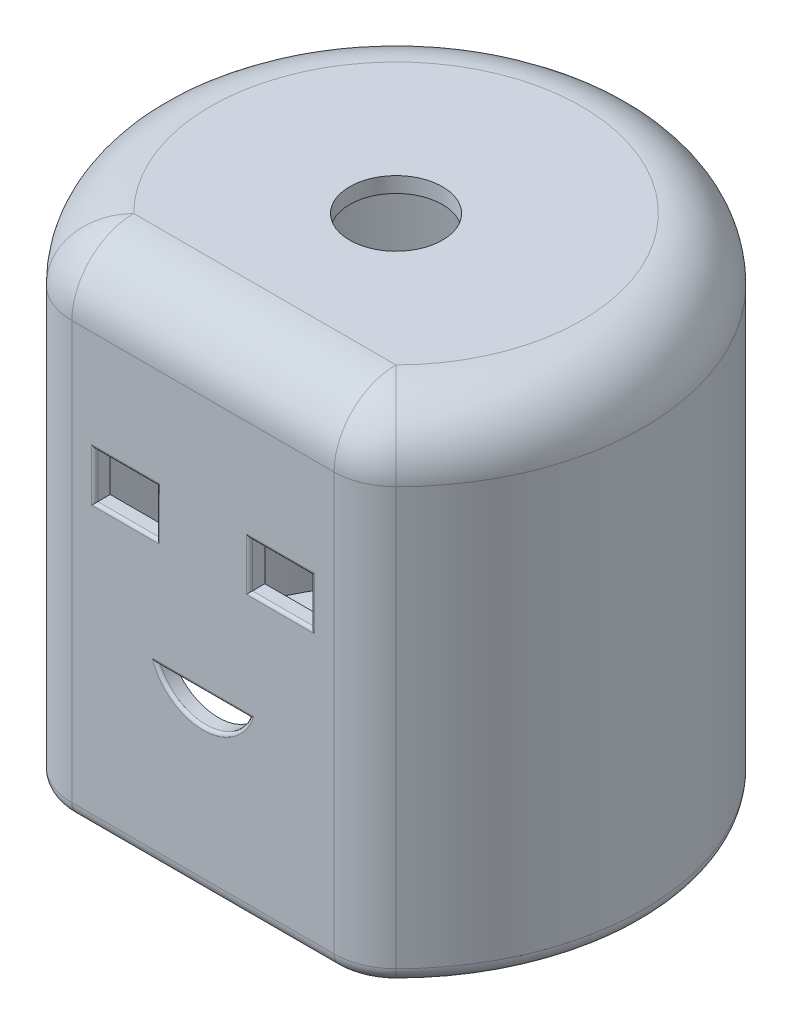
ISO-10303-21;
HEADER;
FILE_DESCRIPTION(('STEP AP214'),'2;1');
FILE_NAME('part.step','',(''),(''),'','','');
FILE_SCHEMA(('AUTOMOTIVE_DESIGN { 1 0 10303 214 1 1 1 1 }'));
ENDSEC;
DATA;
#1=APPLICATION_CONTEXT('core data for automotive mechanical design processes');
#2=APPLICATION_PROTOCOL_DEFINITION('international standard','automotive_design',2000,#1);
#3=PRODUCT_CONTEXT('',#1,'mechanical');
#4=PRODUCT('Part','Part','',(#3));
#5=PRODUCT_RELATED_PRODUCT_CATEGORY('part','',(#4));
#6=PRODUCT_DEFINITION_FORMATION('','',#4);
#7=PRODUCT_DEFINITION_CONTEXT('part definition',#1,'design');
#8=PRODUCT_DEFINITION('design','',#6,#7);
#9=PRODUCT_DEFINITION_SHAPE('','',#8);
#10=(LENGTH_UNIT() NAMED_UNIT(*) SI_UNIT(.MILLI.,.METRE.));
#11=(NAMED_UNIT(*) PLANE_ANGLE_UNIT() SI_UNIT($,.RADIAN.));
#12=(NAMED_UNIT(*) SI_UNIT($,.STERADIAN.) SOLID_ANGLE_UNIT());
#13=UNCERTAINTY_MEASURE_WITH_UNIT(LENGTH_MEASURE(1.E-05),#10,'distance_accuracy_value','');
#14=(GEOMETRIC_REPRESENTATION_CONTEXT(3) GLOBAL_UNCERTAINTY_ASSIGNED_CONTEXT((#13)) GLOBAL_UNIT_ASSIGNED_CONTEXT((#10,
#11,#12)) REPRESENTATION_CONTEXT('',''));
#15=CARTESIAN_POINT('',(0.,0.,0.));
#16=DIRECTION('',(0.,0.,1.));
#17=DIRECTION('',(1.,0.,0.));
#18=AXIS2_PLACEMENT_3D('',#15,#16,#17);
#19=CARTESIAN_POINT('',(0.,203.2,0.));
#20=DIRECTION('',(0.,-1.,0.));
#21=DIRECTION('',(0.,0.,-1.));
#22=AXIS2_PLACEMENT_3D('',#19,#20,#21);
#23=CYLINDRICAL_SURFACE('',#22,101.6);
#24=DIRECTION('',(0.,-1.,0.));
#25=VECTOR('',#24,1.);
#26=CARTESIAN_POINT('',(71.8021096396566,203.2,71.8819661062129));
#27=LINE('',#26,#25);
#28=CARTESIAN_POINT('',(71.8021096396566,177.8,71.8819661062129));
#29=VERTEX_POINT('',#28);
#30=CARTESIAN_POINT('',(71.8021096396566,6.34999999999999,71.8819661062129));
#31=VERTEX_POINT('',#30);
#32=EDGE_CURVE('E446',#29,#31,#27,.T.);
#33=ORIENTED_EDGE('',*,*,#32,.T.);
#34=CARTESIAN_POINT('',(0.,6.34999999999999,0.));
#35=DIRECTION('',(0.,-1.,0.));
#36=DIRECTION('',(0.,0.,-1.));
#37=AXIS2_PLACEMENT_3D('',#34,#35,#36);
#38=CIRCLE('',#37,101.6);
#39=CARTESIAN_POINT('',(-71.8021096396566,6.34999999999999,71.8819661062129));
#40=VERTEX_POINT('',#39);
#41=EDGE_CURVE('E498',#31,#40,#38,.F.);
#42=ORIENTED_EDGE('',*,*,#41,.T.);
#43=DIRECTION('',(0.,-1.,0.));
#44=VECTOR('',#43,1.);
#45=CARTESIAN_POINT('',(-71.8021096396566,203.2,71.8819661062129));
#46=LINE('',#45,#44);
#47=CARTESIAN_POINT('',(-71.8021096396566,177.8,71.8819661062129));
#48=VERTEX_POINT('',#47);
#49=EDGE_CURVE('E440',#40,#48,#46,.F.);
#50=ORIENTED_EDGE('',*,*,#49,.T.);
#51=CARTESIAN_POINT('',(0.,177.8,0.));
#52=DIRECTION('',(0.,-1.,0.));
#53=DIRECTION('',(0.,0.,-1.));
#54=AXIS2_PLACEMENT_3D('',#51,#52,#53);
#55=CIRCLE('',#54,101.6);
#56=EDGE_CURVE('E443',#48,#29,#55,.T.);
#57=ORIENTED_EDGE('',*,*,#56,.T.);
#58=EDGE_LOOP('',(#33,#42,#50,#57));
#59=FACE_BOUND('',#58,.T.);
#60=ADVANCED_FACE('F47',(#59),#23,.T.);
#61=CARTESIAN_POINT('',(-63.5,203.2,79.3114745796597));
#62=DIRECTION('',(0.,0.,-1.));
#63=DIRECTION('',(-1.,0.,0.));
#64=AXIS2_PLACEMENT_3D('',#61,#62,#63);
#65=PLANE('',#64);
#66=DIRECTION('',(1.,0.,0.));
#67=VECTOR('',#66,1.);
#68=CARTESIAN_POINT('',(-63.5,116.205,79.3114745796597));
#69=LINE('',#68,#67);
#70=CARTESIAN_POINT('',(45.72,116.205,79.3114745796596));
#71=VERTEX_POINT('',#70);
#72=CARTESIAN_POINT('',(17.78,116.205,79.3114745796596));
#73=VERTEX_POINT('',#72);
#74=EDGE_CURVE('E579',#71,#73,#69,.F.);
#75=ORIENTED_EDGE('',*,*,#74,.T.);
#76=DIRECTION('',(0.,-1.,0.));
#77=VECTOR('',#76,1.);
#78=CARTESIAN_POINT('',(17.78,203.2,79.3114745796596));
#79=LINE('',#78,#77);
#80=CARTESIAN_POINT('',(17.78,137.795,79.3114745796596));
#81=VERTEX_POINT('',#80);
#82=EDGE_CURVE('E582',#73,#81,#79,.F.);
#83=ORIENTED_EDGE('',*,*,#82,.T.);
#84=DIRECTION('',(-1.,0.,0.));
#85=VECTOR('',#84,1.);
#86=CARTESIAN_POINT('',(-63.5,137.795,79.3114745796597));
#87=LINE('',#86,#85);
#88=CARTESIAN_POINT('',(45.72,137.795,79.3114745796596));
#89=VERTEX_POINT('',#88);
#90=EDGE_CURVE('E573',#81,#89,#87,.F.);
#91=ORIENTED_EDGE('',*,*,#90,.T.);
#92=DIRECTION('',(0.,1.,0.));
#93=VECTOR('',#92,1.);
#94=CARTESIAN_POINT('',(45.72,203.2,79.3114745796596));
#95=LINE('',#94,#93);
#96=EDGE_CURVE('E576',#89,#71,#95,.F.);
#97=ORIENTED_EDGE('',*,*,#96,.T.);
#98=EDGE_LOOP('',(#75,#83,#91,#97));
#99=FACE_BOUND('',#98,.T.);
#100=DIRECTION('',(1.,0.,0.));
#101=VECTOR('',#100,1.);
#102=CARTESIAN_POINT('',(-63.5,116.205,79.3114745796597));
#103=LINE('',#102,#101);
#104=CARTESIAN_POINT('',(-17.78,116.205,79.3114745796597));
#105=VERTEX_POINT('',#104);
#106=CARTESIAN_POINT('',(-45.72,116.205,79.3114745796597));
#107=VERTEX_POINT('',#106);
#108=EDGE_CURVE('E566',#105,#107,#103,.F.);
#109=ORIENTED_EDGE('',*,*,#108,.T.);
#110=DIRECTION('',(0.,-1.,0.));
#111=VECTOR('',#110,1.);
#112=CARTESIAN_POINT('',(-45.72,203.2,79.3114745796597));
#113=LINE('',#112,#111);
#114=CARTESIAN_POINT('',(-45.72,137.795,79.3114745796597));
#115=VERTEX_POINT('',#114);
#116=EDGE_CURVE('E569',#107,#115,#113,.F.);
#117=ORIENTED_EDGE('',*,*,#116,.T.);
#118=DIRECTION('',(-1.,0.,0.));
#119=VECTOR('',#118,1.);
#120=CARTESIAN_POINT('',(-63.5,137.795,79.3114745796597));
#121=LINE('',#120,#119);
#122=CARTESIAN_POINT('',(-17.78,137.795,79.3114745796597));
#123=VERTEX_POINT('',#122);
#124=EDGE_CURVE('E560',#115,#123,#121,.F.);
#125=ORIENTED_EDGE('',*,*,#124,.T.);
#126=DIRECTION('',(0.,1.,0.));
#127=VECTOR('',#126,1.);
#128=CARTESIAN_POINT('',(-17.78,203.2,79.3114745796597));
#129=LINE('',#128,#127);
#130=EDGE_CURVE('E563',#123,#105,#129,.F.);
#131=ORIENTED_EDGE('',*,*,#130,.T.);
#132=EDGE_LOOP('',(#109,#117,#125,#131));
#133=FACE_BOUND('',#132,.T.);
#134=DIRECTION('',(-1.,0.,0.));
#135=VECTOR('',#134,1.);
#136=CARTESIAN_POINT('',(-63.5,74.295,79.3114745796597));
#137=LINE('',#136,#135);
#138=CARTESIAN_POINT('',(-20.8682294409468,74.295,79.3114745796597));
#139=VERTEX_POINT('',#138);
#140=CARTESIAN_POINT('',(20.8682294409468,74.295,79.3114745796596));
#141=VERTEX_POINT('',#140);
#142=EDGE_CURVE('E553',#139,#141,#137,.F.);
#143=ORIENTED_EDGE('',*,*,#142,.T.);
#144=CARTESIAN_POINT('',(0.,80.9625,79.3114745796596));
#145=DIRECTION('',(0.,0.,-1.));
#146=DIRECTION('',(-1.,0.,0.));
#147=AXIS2_PLACEMENT_3D('',#144,#145,#146);
#148=CIRCLE('',#147,21.9075);
#149=EDGE_CURVE('E556',#141,#139,#148,.T.);
#150=ORIENTED_EDGE('',*,*,#149,.T.);
#151=EDGE_LOOP('',(#143,#150));
#152=FACE_BOUND('',#151,.T.);
#153=DIRECTION('',(0.,-1.,0.));
#154=VECTOR('',#153,1.);
#155=CARTESIAN_POINT('',(-53.8515822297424,203.2,79.3114745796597));
#156=LINE('',#155,#154);
#157=CARTESIAN_POINT('',(-53.8515822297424,177.8,79.3114745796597));
#158=VERTEX_POINT('',#157);
#159=CARTESIAN_POINT('',(-53.8515822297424,6.34999999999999,79.3114745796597));
#160=VERTEX_POINT('',#159);
#161=EDGE_CURVE('E429',#158,#160,#156,.T.);
#162=ORIENTED_EDGE('',*,*,#161,.T.);
#163=DIRECTION('',(1.,0.,0.));
#164=VECTOR('',#163,1.);
#165=CARTESIAN_POINT('',(53.8515822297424,6.34999999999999,79.3114745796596));
#166=LINE('',#165,#164);
#167=CARTESIAN_POINT('',(53.8515822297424,6.34999999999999,79.3114745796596));
#168=VERTEX_POINT('',#167);
#169=EDGE_CURVE('E492',#160,#168,#166,.T.);
#170=ORIENTED_EDGE('',*,*,#169,.T.);
#171=DIRECTION('',(0.,-1.,0.));
#172=VECTOR('',#171,1.);
#173=CARTESIAN_POINT('',(53.8515822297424,203.2,79.3114745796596));
#174=LINE('',#173,#172);
#175=CARTESIAN_POINT('',(53.8515822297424,177.8,79.3114745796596));
#176=VERTEX_POINT('',#175);
#177=EDGE_CURVE('E437',#168,#176,#174,.F.);
#178=ORIENTED_EDGE('',*,*,#177,.T.);
#179=DIRECTION('',(1.,0.,0.));
#180=VECTOR('',#179,1.);
#181=CARTESIAN_POINT('',(-63.5,177.8,79.3114745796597));
#182=LINE('',#181,#180);
#183=EDGE_CURVE('E433',#176,#158,#182,.F.);
#184=ORIENTED_EDGE('',*,*,#183,.T.);
#185=EDGE_LOOP('',(#162,#170,#178,#184));
#186=FACE_BOUND('',#185,.T.);
#187=ADVANCED_FACE('F724',(#99,#133,#152,#186),#65,.F.);
#188=CARTESIAN_POINT('',(0.,203.2,0.));
#189=DIRECTION('',(0.,-1.,0.));
#190=DIRECTION('',(0.,0.,-1.));
#191=AXIS2_PLACEMENT_3D('',#188,#189,#190);
#192=PLANE('',#191);
#193=CARTESIAN_POINT('',(0.,203.2,0.));
#194=DIRECTION('',(0.,1.,0.));
#195=DIRECTION('',(0.,0.,1.));
#196=AXIS2_PLACEMENT_3D('',#193,#194,#195);
#197=CIRCLE('',#196,19.05);
#198=CARTESIAN_POINT('',(0.,203.2,19.05));
#199=VERTEX_POINT('',#198);
#200=EDGE_CURVE('E324',#199,#199,#197,.T.);
#201=ORIENTED_EDGE('',*,*,#200,.F.);
#202=EDGE_LOOP('',(#201));
#203=FACE_BOUND('',#202,.T.);
#204=CARTESIAN_POINT('',(0.,203.2,0.));
#205=DIRECTION('',(0.,-1.,0.));
#206=DIRECTION('',(0.,0.,-1.));
#207=AXIS2_PLACEMENT_3D('',#204,#205,#206);
#208=CIRCLE('',#207,76.2);
#209=CARTESIAN_POINT('',(53.8515822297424,203.2,53.9114745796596));
#210=VERTEX_POINT('',#209);
#211=CARTESIAN_POINT('',(-53.8515822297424,203.2,53.9114745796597));
#212=VERTEX_POINT('',#211);
#213=EDGE_CURVE('E421',#210,#212,#208,.F.);
#214=ORIENTED_EDGE('',*,*,#213,.T.);
#215=DIRECTION('',(1.,0.,0.));
#216=VECTOR('',#215,1.);
#217=CARTESIAN_POINT('',(0.,203.2,53.9114745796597));
#218=LINE('',#217,#216);
#219=EDGE_CURVE('E424',#212,#210,#218,.T.);
#220=ORIENTED_EDGE('',*,*,#219,.T.);
#221=EDGE_LOOP('',(#214,#220));
#222=FACE_BOUND('',#221,.T.);
#223=ADVANCED_FACE('F702',(#203,#222),#192,.F.);
#224=CARTESIAN_POINT('',(-53.8515822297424,203.2,53.9114745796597));
#225=DIRECTION('',(0.,-1.,0.));
#226=DIRECTION('',(0.,0.,-1.));
#227=AXIS2_PLACEMENT_3D('',#224,#225,#226);
#228=CYLINDRICAL_SURFACE('',#227,25.4);
#229=ORIENTED_EDGE('',*,*,#49,.F.);
#230=CARTESIAN_POINT('',(-53.8515822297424,6.34999999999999,53.9114745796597));
#231=DIRECTION('',(0.,-1.,0.));
#232=DIRECTION('',(0.,0.,-1.));
#233=AXIS2_PLACEMENT_3D('',#230,#231,#232);
#234=CIRCLE('',#233,25.4);
#235=EDGE_CURVE('E488',#40,#160,#234,.F.);
#236=ORIENTED_EDGE('',*,*,#235,.T.);
#237=ORIENTED_EDGE('',*,*,#161,.F.);
#238=CARTESIAN_POINT('',(-53.8515822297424,177.8,53.9114745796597));
#239=DIRECTION('',(0.,1.,0.));
#240=DIRECTION('',(0.,0.,1.));
#241=AXIS2_PLACEMENT_3D('',#238,#239,#240);
#242=CIRCLE('',#241,25.4);
#243=EDGE_CURVE('E425',#48,#158,#242,.T.);
#244=ORIENTED_EDGE('',*,*,#243,.F.);
#245=EDGE_LOOP('',(#229,#236,#237,#244));
#246=FACE_BOUND('',#245,.T.);
#247=ADVANCED_FACE('F698',(#246),#228,.T.);
#248=CARTESIAN_POINT('',(0.,177.8,0.));
#249=DIRECTION('',(0.,-1.,0.));
#250=DIRECTION('',(0.,0.,-1.));
#251=AXIS2_PLACEMENT_3D('',#248,#249,#250);
#252=TOROIDAL_SURFACE('',#251,76.2,25.4);
#253=CARTESIAN_POINT('',(53.8515822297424,177.8,53.9114745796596));
#254=DIRECTION('',(-0.707499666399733,0.,0.706713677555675));
#255=DIRECTION('',(0.706713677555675,0.,0.707499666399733));
#256=AXIS2_PLACEMENT_3D('',#253,#254,#255);
#257=CIRCLE('',#256,25.4);
#258=EDGE_CURVE('E462',#29,#210,#257,.T.);
#259=ORIENTED_EDGE('',*,*,#258,.F.);
#260=ORIENTED_EDGE('',*,*,#56,.F.);
#261=CARTESIAN_POINT('',(-53.8515822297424,177.8,53.9114745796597));
#262=DIRECTION('',(0.707499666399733,0.,0.706713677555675));
#263=DIRECTION('',(0.706713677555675,0.,-0.707499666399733));
#264=AXIS2_PLACEMENT_3D('',#261,#262,#263);
#265=CIRCLE('',#264,25.4);
#266=EDGE_CURVE('E466',#212,#48,#265,.T.);
#267=ORIENTED_EDGE('',*,*,#266,.F.);
#268=ORIENTED_EDGE('',*,*,#213,.F.);
#269=EDGE_LOOP('',(#259,#260,#267,#268));
#270=FACE_BOUND('',#269,.T.);
#271=ADVANCED_FACE('F701',(#270),#252,.T.);
#272=CARTESIAN_POINT('',(53.8515822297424,203.2,53.9114745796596));
#273=DIRECTION('',(0.,-1.,0.));
#274=DIRECTION('',(0.,0.,-1.));
#275=AXIS2_PLACEMENT_3D('',#272,#273,#274);
#276=CYLINDRICAL_SURFACE('',#275,25.4);
#277=ORIENTED_EDGE('',*,*,#177,.F.);
#278=CARTESIAN_POINT('',(53.8515822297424,6.34999999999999,53.9114745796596));
#279=DIRECTION('',(0.,-1.,0.));
#280=DIRECTION('',(0.,0.,-1.));
#281=AXIS2_PLACEMENT_3D('',#278,#279,#280);
#282=CIRCLE('',#281,25.4);
#283=EDGE_CURVE('E495',#168,#31,#282,.F.);
#284=ORIENTED_EDGE('',*,*,#283,.T.);
#285=ORIENTED_EDGE('',*,*,#32,.F.);
#286=CARTESIAN_POINT('',(53.8515822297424,177.8,53.9114745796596));
#287=DIRECTION('',(0.,1.,0.));
#288=DIRECTION('',(0.,0.,1.));
#289=AXIS2_PLACEMENT_3D('',#286,#287,#288);
#290=CIRCLE('',#289,25.4);
#291=EDGE_CURVE('E458',#176,#29,#290,.T.);
#292=ORIENTED_EDGE('',*,*,#291,.F.);
#293=EDGE_LOOP('',(#277,#284,#285,#292));
#294=FACE_BOUND('',#293,.T.);
#295=ADVANCED_FACE('F706',(#294),#276,.T.);
#296=CARTESIAN_POINT('',(-53.8515822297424,177.8,53.9114745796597));
#297=DIRECTION('',(0.,1.,0.));
#298=DIRECTION('',(0.,0.,1.));
#299=AXIS2_PLACEMENT_3D('',#296,#297,#298);
#300=SPHERICAL_SURFACE('',#299,25.4);
#301=ORIENTED_EDGE('',*,*,#266,.T.);
#302=ORIENTED_EDGE('',*,*,#243,.T.);
#303=CARTESIAN_POINT('',(-53.8515822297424,177.8,53.9114745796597));
#304=DIRECTION('',(-1.,0.,0.));
#305=DIRECTION('',(0.,-1.,0.));
#306=AXIS2_PLACEMENT_3D('',#303,#304,#305);
#307=CIRCLE('',#306,25.4);
#308=EDGE_CURVE('E454',#212,#158,#307,.F.);
#309=ORIENTED_EDGE('',*,*,#308,.F.);
#310=EDGE_LOOP('',(#301,#302,#309));
#311=FACE_BOUND('',#310,.T.);
#312=ADVANCED_FACE('F710',(#311),#300,.T.);
#313=CARTESIAN_POINT('',(53.8515822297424,177.8,53.9114745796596));
#314=DIRECTION('',(0.,1.,0.));
#315=DIRECTION('',(-1.,0.,0.));
#316=AXIS2_PLACEMENT_3D('',#313,#314,#315);
#317=SPHERICAL_SURFACE('',#316,25.4);
#318=ORIENTED_EDGE('',*,*,#291,.T.);
#319=ORIENTED_EDGE('',*,*,#258,.T.);
#320=CARTESIAN_POINT('',(53.8515822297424,177.8,53.9114745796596));
#321=DIRECTION('',(1.,0.,0.));
#322=DIRECTION('',(0.,0.,-1.));
#323=AXIS2_PLACEMENT_3D('',#320,#321,#322);
#324=CIRCLE('',#323,25.4);
#325=EDGE_CURVE('E451',#176,#210,#324,.F.);
#326=ORIENTED_EDGE('',*,*,#325,.F.);
#327=EDGE_LOOP('',(#318,#319,#326));
#328=FACE_BOUND('',#327,.T.);
#329=ADVANCED_FACE('F714',(#328),#317,.T.);
#330=CARTESIAN_POINT('',(0.,177.8,53.9114745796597));
#331=DIRECTION('',(1.,0.,0.));
#332=DIRECTION('',(0.,0.,-1.));
#333=AXIS2_PLACEMENT_3D('',#330,#331,#332);
#334=CYLINDRICAL_SURFACE('',#333,25.4);
#335=ORIENTED_EDGE('',*,*,#308,.T.);
#336=ORIENTED_EDGE('',*,*,#183,.F.);
#337=ORIENTED_EDGE('',*,*,#325,.T.);
#338=ORIENTED_EDGE('',*,*,#219,.F.);
#339=EDGE_LOOP('',(#335,#336,#337,#338));
#340=FACE_BOUND('',#339,.T.);
#341=ADVANCED_FACE('F684',(#340),#334,.T.);
#342=CARTESIAN_POINT('',(53.8515822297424,6.34999999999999,53.9114745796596));
#343=DIRECTION('',(0.,-1.,0.));
#344=DIRECTION('',(0.,0.,-1.));
#345=AXIS2_PLACEMENT_3D('',#342,#343,#344);
#346=TOROIDAL_SURFACE('',#345,19.05,6.35);
#347=CARTESIAN_POINT('',(67.3144777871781,6.34999999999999,67.3893432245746));
#348=DIRECTION('',(0.707499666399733,0.,-0.706713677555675));
#349=DIRECTION('',(-0.706713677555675,0.,-0.707499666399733));
#350=AXIS2_PLACEMENT_3D('',#347,#348,#349);
#351=CIRCLE('',#350,6.35);
#352=CARTESIAN_POINT('',(67.3144777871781,0.,67.3893432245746));
#353=VERTEX_POINT('',#352);
#354=EDGE_CURVE('E507',#31,#353,#351,.T.);
#355=ORIENTED_EDGE('',*,*,#354,.F.);
#356=ORIENTED_EDGE('',*,*,#283,.F.);
#357=CARTESIAN_POINT('',(53.8515822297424,6.35,72.9614745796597));
#358=DIRECTION('',(-1.,0.,0.));
#359=DIRECTION('',(0.,0.,1.));
#360=AXIS2_PLACEMENT_3D('',#357,#358,#359);
#361=CIRCLE('',#360,6.35);
#362=CARTESIAN_POINT('',(53.8515822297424,0.,72.9614745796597));
#363=VERTEX_POINT('',#362);
#364=EDGE_CURVE('E455',#363,#168,#361,.T.);
#365=ORIENTED_EDGE('',*,*,#364,.F.);
#366=CARTESIAN_POINT('',(53.8515822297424,0.,53.9114745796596));
#367=DIRECTION('',(0.,-1.,0.));
#368=DIRECTION('',(0.,0.,-1.));
#369=AXIS2_PLACEMENT_3D('',#366,#367,#368);
#370=CIRCLE('',#369,19.05);
#371=EDGE_CURVE('E476',#353,#363,#370,.T.);
#372=ORIENTED_EDGE('',*,*,#371,.F.);
#373=EDGE_LOOP('',(#355,#356,#365,#372));
#374=FACE_BOUND('',#373,.T.);
#375=ADVANCED_FACE('F680',(#374),#346,.T.);
#376=CARTESIAN_POINT('',(-63.5,6.34999999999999,72.9614745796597));
#377=DIRECTION('',(-1.,0.,0.));
#378=DIRECTION('',(0.,0.,1.));
#379=AXIS2_PLACEMENT_3D('',#376,#377,#378);
#380=CYLINDRICAL_SURFACE('',#379,6.35);
#381=ORIENTED_EDGE('',*,*,#364,.T.);
#382=ORIENTED_EDGE('',*,*,#169,.F.);
#383=CARTESIAN_POINT('',(-53.8515822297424,6.35,72.9614745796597));
#384=DIRECTION('',(-1.,0.,0.));
#385=DIRECTION('',(0.,0.,1.));
#386=AXIS2_PLACEMENT_3D('',#383,#384,#385);
#387=CIRCLE('',#386,6.35);
#388=CARTESIAN_POINT('',(-53.8515822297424,0.,72.9614745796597));
#389=VERTEX_POINT('',#388);
#390=EDGE_CURVE('E504',#389,#160,#387,.T.);
#391=ORIENTED_EDGE('',*,*,#390,.F.);
#392=DIRECTION('',(1.,0.,0.));
#393=VECTOR('',#392,1.);
#394=CARTESIAN_POINT('',(-53.8515822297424,0.,72.9614745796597));
#395=LINE('',#394,#393);
#396=EDGE_CURVE('E480',#363,#389,#395,.F.);
#397=ORIENTED_EDGE('',*,*,#396,.F.);
#398=EDGE_LOOP('',(#381,#382,#391,#397));
#399=FACE_BOUND('',#398,.T.);
#400=ADVANCED_FACE('F683',(#399),#380,.T.);
#401=CARTESIAN_POINT('',(0.,6.34999999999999,0.));
#402=DIRECTION('',(0.,-1.,0.));
#403=DIRECTION('',(0.,0.,-1.));
#404=AXIS2_PLACEMENT_3D('',#401,#402,#403);
#405=TOROIDAL_SURFACE('',#404,95.25,6.35);
#406=ORIENTED_EDGE('',*,*,#354,.T.);
#407=CARTESIAN_POINT('',(0.,0.,0.));
#408=DIRECTION('',(0.,-1.,0.));
#409=DIRECTION('',(0.,0.,-1.));
#410=AXIS2_PLACEMENT_3D('',#407,#408,#409);
#411=CIRCLE('',#410,95.25);
#412=CARTESIAN_POINT('',(-67.314477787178,0.,67.3893432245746));
#413=VERTEX_POINT('',#412);
#414=EDGE_CURVE('E450',#413,#353,#411,.T.);
#415=ORIENTED_EDGE('',*,*,#414,.F.);
#416=CARTESIAN_POINT('',(-67.314477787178,6.34999999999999,67.3893432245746));
#417=DIRECTION('',(0.707499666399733,0.,0.706713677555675));
#418=DIRECTION('',(0.706713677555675,0.,-0.707499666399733));
#419=AXIS2_PLACEMENT_3D('',#416,#417,#418);
#420=CIRCLE('',#419,6.35);
#421=EDGE_CURVE('E375',#40,#413,#420,.T.);
#422=ORIENTED_EDGE('',*,*,#421,.F.);
#423=ORIENTED_EDGE('',*,*,#41,.F.);
#424=EDGE_LOOP('',(#406,#415,#422,#423));
#425=FACE_BOUND('',#424,.T.);
#426=ADVANCED_FACE('F688',(#425),#405,.T.);
#427=CARTESIAN_POINT('',(-53.8515822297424,6.34999999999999,53.9114745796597));
#428=DIRECTION('',(0.,-1.,0.));
#429=DIRECTION('',(0.,0.,-1.));
#430=AXIS2_PLACEMENT_3D('',#427,#428,#429);
#431=TOROIDAL_SURFACE('',#430,19.05,6.35);
#432=ORIENTED_EDGE('',*,*,#390,.T.);
#433=ORIENTED_EDGE('',*,*,#235,.F.);
#434=ORIENTED_EDGE('',*,*,#421,.T.);
#435=CARTESIAN_POINT('',(-53.8515822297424,0.,53.9114745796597));
#436=DIRECTION('',(0.,-1.,0.));
#437=DIRECTION('',(0.,0.,-1.));
#438=AXIS2_PLACEMENT_3D('',#435,#436,#437);
#439=CIRCLE('',#438,19.05);
#440=EDGE_CURVE('E484',#389,#413,#439,.T.);
#441=ORIENTED_EDGE('',*,*,#440,.F.);
#442=EDGE_LOOP('',(#432,#433,#434,#441));
#443=FACE_BOUND('',#442,.T.);
#444=ADVANCED_FACE('F692',(#443),#431,.T.);
#445=CARTESIAN_POINT('',(0.,203.2,0.));
#446=DIRECTION('',(0.,-1.,0.));
#447=DIRECTION('',(0.,0.,-1.));
#448=AXIS2_PLACEMENT_3D('',#445,#446,#447);
#449=CYLINDRICAL_SURFACE('',#448,95.25);
#450=CARTESIAN_POINT('',(0.,3.81,0.));
#451=DIRECTION('',(0.,1.,0.));
#452=DIRECTION('',(0.,0.,1.));
#453=AXIS2_PLACEMENT_3D('',#450,#451,#452);
#454=CIRCLE('',#453,95.25);
#455=CARTESIAN_POINT('',(67.3144777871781,3.81,67.3893432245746));
#456=VERTEX_POINT('',#455);
#457=CARTESIAN_POINT('',(-67.314477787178,3.81,67.3893432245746));
#458=VERTEX_POINT('',#457);
#459=EDGE_CURVE('E316',#456,#458,#454,.T.);
#460=ORIENTED_EDGE('',*,*,#459,.F.);
#461=DIRECTION('',(0.,-1.,0.));
#462=VECTOR('',#461,1.);
#463=CARTESIAN_POINT('',(67.3144777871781,203.2,67.3893432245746));
#464=LINE('',#463,#462);
#465=CARTESIAN_POINT('',(67.3144777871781,177.8,67.3893432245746));
#466=VERTEX_POINT('',#465);
#467=EDGE_CURVE('E371',#466,#456,#464,.T.);
#468=ORIENTED_EDGE('',*,*,#467,.F.);
#469=CARTESIAN_POINT('',(0.,177.8,0.));
#470=DIRECTION('',(0.,-1.,0.));
#471=DIRECTION('',(0.,0.,-1.));
#472=AXIS2_PLACEMENT_3D('',#469,#470,#471);
#473=CIRCLE('',#472,95.25);
#474=CARTESIAN_POINT('',(-67.314477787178,177.8,67.3893432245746));
#475=VERTEX_POINT('',#474);
#476=EDGE_CURVE('E376',#475,#466,#473,.T.);
#477=ORIENTED_EDGE('',*,*,#476,.F.);
#478=DIRECTION('',(0.,-1.,0.));
#479=VECTOR('',#478,1.);
#480=CARTESIAN_POINT('',(-67.314477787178,203.2,67.3893432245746));
#481=LINE('',#480,#479);
#482=EDGE_CURVE('E377',#458,#475,#481,.F.);
#483=ORIENTED_EDGE('',*,*,#482,.F.);
#484=EDGE_LOOP('',(#460,#468,#477,#483));
#485=FACE_BOUND('',#484,.T.);
#486=ADVANCED_FACE('F696',(#485),#449,.F.);
#487=CARTESIAN_POINT('',(-63.5,203.2,72.9614745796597));
#488=DIRECTION('',(0.,0.,-1.));
#489=DIRECTION('',(-1.,0.,0.));
#490=AXIS2_PLACEMENT_3D('',#487,#488,#489);
#491=PLANE('',#490);
#492=DIRECTION('',(1.,0.,0.));
#493=VECTOR('',#492,1.);
#494=CARTESIAN_POINT('',(53.8515822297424,3.81,72.9614745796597));
#495=LINE('',#494,#493);
#496=CARTESIAN_POINT('',(-53.8515822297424,3.81,72.9614745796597));
#497=VERTEX_POINT('',#496);
#498=CARTESIAN_POINT('',(53.8515822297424,3.81000000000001,72.9614745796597));
#499=VERTEX_POINT('',#498);
#500=EDGE_CURVE('E70',#497,#499,#495,.T.);
#501=ORIENTED_EDGE('',*,*,#500,.F.);
#502=DIRECTION('',(0.,1.,0.));
#503=VECTOR('',#502,1.);
#504=CARTESIAN_POINT('',(-53.8515822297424,203.2,72.9614745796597));
#505=LINE('',#504,#503);
#506=CARTESIAN_POINT('',(-53.8515822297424,177.8,72.9614745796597));
#507=VERTEX_POINT('',#506);
#508=EDGE_CURVE('E383',#507,#497,#505,.F.);
#509=ORIENTED_EDGE('',*,*,#508,.F.);
#510=DIRECTION('',(-1.,0.,0.));
#511=VECTOR('',#510,1.);
#512=CARTESIAN_POINT('',(-63.5,177.8,72.9614745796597));
#513=LINE('',#512,#511);
#514=CARTESIAN_POINT('',(53.8515822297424,177.8,72.9614745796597));
#515=VERTEX_POINT('',#514);
#516=EDGE_CURVE('E387',#515,#507,#513,.T.);
#517=ORIENTED_EDGE('',*,*,#516,.F.);
#518=DIRECTION('',(0.,1.,0.));
#519=VECTOR('',#518,1.);
#520=CARTESIAN_POINT('',(53.8515822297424,203.2,72.9614745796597));
#521=LINE('',#520,#519);
#522=EDGE_CURVE('E380',#499,#515,#521,.T.);
#523=ORIENTED_EDGE('',*,*,#522,.F.);
#524=EDGE_LOOP('',(#501,#509,#517,#523));
#525=FACE_BOUND('',#524,.T.);
#526=CARTESIAN_POINT('',(0.,80.9625,72.9614745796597));
#527=DIRECTION('',(0.,0.,-1.));
#528=DIRECTION('',(-1.,0.,0.));
#529=AXIS2_PLACEMENT_3D('',#526,#527,#528);
#530=CIRCLE('',#529,20.6375);
#531=CARTESIAN_POINT('',(19.05,73.025,72.9614745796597));
#532=VERTEX_POINT('',#531);
#533=CARTESIAN_POINT('',(-19.05,73.025,72.9614745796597));
#534=VERTEX_POINT('',#533);
#535=EDGE_CURVE('E542',#532,#534,#530,.T.);
#536=ORIENTED_EDGE('',*,*,#535,.F.);
#537=DIRECTION('',(1.,0.,0.));
#538=VECTOR('',#537,1.);
#539=CARTESIAN_POINT('',(-63.5,73.025,72.9614745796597));
#540=LINE('',#539,#538);
#541=EDGE_CURVE('E539',#534,#532,#540,.T.);
#542=ORIENTED_EDGE('',*,*,#541,.F.);
#543=EDGE_LOOP('',(#536,#542));
#544=FACE_BOUND('',#543,.T.);
#545=DIRECTION('',(0.,-1.,0.));
#546=VECTOR('',#545,1.);
#547=CARTESIAN_POINT('',(-19.05,203.2,72.9614745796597));
#548=LINE('',#547,#546);
#549=CARTESIAN_POINT('',(-19.05,136.525,72.9614745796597));
#550=VERTEX_POINT('',#549);
#551=CARTESIAN_POINT('',(-19.05,117.475,72.9614745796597));
#552=VERTEX_POINT('',#551);
#553=EDGE_CURVE('E536',#550,#552,#548,.T.);
#554=ORIENTED_EDGE('',*,*,#553,.F.);
#555=DIRECTION('',(1.,0.,0.));
#556=VECTOR('',#555,1.);
#557=CARTESIAN_POINT('',(-63.5,136.525,72.9614745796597));
#558=LINE('',#557,#556);
#559=CARTESIAN_POINT('',(-44.45,136.525,72.9614745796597));
#560=VERTEX_POINT('',#559);
#561=EDGE_CURVE('E526',#560,#550,#558,.T.);
#562=ORIENTED_EDGE('',*,*,#561,.F.);
#563=DIRECTION('',(0.,1.,0.));
#564=VECTOR('',#563,1.);
#565=CARTESIAN_POINT('',(-44.45,203.2,72.9614745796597));
#566=LINE('',#565,#564);
#567=CARTESIAN_POINT('',(-44.45,117.475,72.9614745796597));
#568=VERTEX_POINT('',#567);
#569=EDGE_CURVE('E529',#568,#560,#566,.T.);
#570=ORIENTED_EDGE('',*,*,#569,.F.);
#571=DIRECTION('',(-1.,0.,0.));
#572=VECTOR('',#571,1.);
#573=CARTESIAN_POINT('',(-63.5,117.475,72.9614745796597));
#574=LINE('',#573,#572);
#575=EDGE_CURVE('E533',#552,#568,#574,.T.);
#576=ORIENTED_EDGE('',*,*,#575,.F.);
#577=EDGE_LOOP('',(#554,#562,#570,#576));
#578=FACE_BOUND('',#577,.T.);
#579=DIRECTION('',(0.,-1.,0.));
#580=VECTOR('',#579,1.);
#581=CARTESIAN_POINT('',(44.45,203.2,72.9614745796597));
#582=LINE('',#581,#580);
#583=CARTESIAN_POINT('',(44.45,136.525,72.9614745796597));
#584=VERTEX_POINT('',#583);
#585=CARTESIAN_POINT('',(44.45,117.475,72.9614745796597));
#586=VERTEX_POINT('',#585);
#587=EDGE_CURVE('E523',#584,#586,#582,.T.);
#588=ORIENTED_EDGE('',*,*,#587,.F.);
#589=DIRECTION('',(1.,0.,0.));
#590=VECTOR('',#589,1.);
#591=CARTESIAN_POINT('',(-63.5,136.525,72.9614745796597));
#592=LINE('',#591,#590);
#593=CARTESIAN_POINT('',(19.05,136.525,72.9614745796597));
#594=VERTEX_POINT('',#593);
#595=EDGE_CURVE('E501',#594,#584,#592,.T.);
#596=ORIENTED_EDGE('',*,*,#595,.F.);
#597=DIRECTION('',(0.,1.,0.));
#598=VECTOR('',#597,1.);
#599=CARTESIAN_POINT('',(19.05,203.2,72.9614745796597));
#600=LINE('',#599,#598);
#601=CARTESIAN_POINT('',(19.05,117.475,72.9614745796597));
#602=VERTEX_POINT('',#601);
#603=EDGE_CURVE('E516',#602,#594,#600,.T.);
#604=ORIENTED_EDGE('',*,*,#603,.F.);
#605=DIRECTION('',(-1.,0.,0.));
#606=VECTOR('',#605,1.);
#607=CARTESIAN_POINT('',(-63.5,117.475,72.9614745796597));
#608=LINE('',#607,#606);
#609=EDGE_CURVE('E520',#586,#602,#608,.T.);
#610=ORIENTED_EDGE('',*,*,#609,.F.);
#611=EDGE_LOOP('',(#588,#596,#604,#610));
#612=FACE_BOUND('',#611,.T.);
#613=ADVANCED_FACE('F760',(#525,#544,#578,#612),#491,.T.);
#614=CARTESIAN_POINT('',(0.,196.85,0.));
#615=DIRECTION('',(0.,-1.,0.));
#616=DIRECTION('',(0.,0.,-1.));
#617=AXIS2_PLACEMENT_3D('',#614,#615,#616);
#618=PLANE('',#617);
#619=CARTESIAN_POINT('',(0.,196.85,0.));
#620=DIRECTION('',(0.,-1.,0.));
#621=DIRECTION('',(0.,0.,-1.));
#622=AXIS2_PLACEMENT_3D('',#619,#620,#621);
#623=CIRCLE('',#622,19.05);
#624=CARTESIAN_POINT('',(0.,196.85,-19.05));
#625=VERTEX_POINT('',#624);
#626=EDGE_CURVE('E328',#625,#625,#623,.T.);
#627=ORIENTED_EDGE('',*,*,#626,.F.);
#628=EDGE_LOOP('',(#627));
#629=FACE_BOUND('',#628,.T.);
#630=CARTESIAN_POINT('',(0.,196.85,0.));
#631=DIRECTION('',(0.,-1.,0.));
#632=DIRECTION('',(0.,0.,-1.));
#633=AXIS2_PLACEMENT_3D('',#630,#631,#632);
#634=CIRCLE('',#633,76.2);
#635=CARTESIAN_POINT('',(53.8515822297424,196.85,53.9114745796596));
#636=VERTEX_POINT('',#635);
#637=CARTESIAN_POINT('',(-53.8515822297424,196.85,53.9114745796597));
#638=VERTEX_POINT('',#637);
#639=EDGE_CURVE('E393',#636,#638,#634,.F.);
#640=ORIENTED_EDGE('',*,*,#639,.F.);
#641=DIRECTION('',(1.,0.,0.));
#642=VECTOR('',#641,1.);
#643=CARTESIAN_POINT('',(0.,196.85,53.9114745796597));
#644=LINE('',#643,#642);
#645=EDGE_CURVE('E388',#638,#636,#644,.T.);
#646=ORIENTED_EDGE('',*,*,#645,.F.);
#647=EDGE_LOOP('',(#640,#646));
#648=FACE_BOUND('',#647,.T.);
#649=ADVANCED_FACE('F756',(#629,#648),#618,.T.);
#650=CARTESIAN_POINT('',(-53.8515822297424,203.2,53.9114745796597));
#651=DIRECTION('',(0.,-1.,0.));
#652=DIRECTION('',(0.,0.,-1.));
#653=AXIS2_PLACEMENT_3D('',#650,#651,#652);
#654=CYLINDRICAL_SURFACE('',#653,19.05);
#655=ORIENTED_EDGE('',*,*,#508,.T.);
#656=CARTESIAN_POINT('',(-53.8515822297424,3.81,53.9114745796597));
#657=DIRECTION('',(0.,1.,0.));
#658=DIRECTION('',(0.,0.,1.));
#659=AXIS2_PLACEMENT_3D('',#656,#657,#658);
#660=CIRCLE('',#659,19.05);
#661=EDGE_CURVE('E319',#458,#497,#660,.T.);
#662=ORIENTED_EDGE('',*,*,#661,.F.);
#663=ORIENTED_EDGE('',*,*,#482,.T.);
#664=CARTESIAN_POINT('',(-53.8515822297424,177.8,53.9114745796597));
#665=DIRECTION('',(0.,1.,0.));
#666=DIRECTION('',(0.,0.,1.));
#667=AXIS2_PLACEMENT_3D('',#664,#665,#666);
#668=CIRCLE('',#667,19.05);
#669=EDGE_CURVE('E389',#475,#507,#668,.T.);
#670=ORIENTED_EDGE('',*,*,#669,.T.);
#671=EDGE_LOOP('',(#655,#662,#663,#670));
#672=FACE_BOUND('',#671,.T.);
#673=ADVANCED_FACE('F752',(#672),#654,.F.);
#674=CARTESIAN_POINT('',(0.,177.8,0.));
#675=DIRECTION('',(0.,-1.,0.));
#676=DIRECTION('',(0.,0.,-1.));
#677=AXIS2_PLACEMENT_3D('',#674,#675,#676);
#678=TOROIDAL_SURFACE('',#677,76.2,19.05);
#679=CARTESIAN_POINT('',(53.8515822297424,177.8,53.9114745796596));
#680=DIRECTION('',(-0.707499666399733,0.,0.706713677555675));
#681=DIRECTION('',(0.706713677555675,0.,0.707499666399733));
#682=AXIS2_PLACEMENT_3D('',#679,#680,#681);
#683=CIRCLE('',#682,19.05);
#684=EDGE_CURVE('E404',#466,#636,#683,.T.);
#685=ORIENTED_EDGE('',*,*,#684,.T.);
#686=ORIENTED_EDGE('',*,*,#639,.T.);
#687=CARTESIAN_POINT('',(-53.8515822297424,177.8,53.9114745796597));
#688=DIRECTION('',(-0.707499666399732,0.,-0.706713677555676));
#689=DIRECTION('',(-0.706713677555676,0.,0.707499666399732));
#690=AXIS2_PLACEMENT_3D('',#687,#688,#689);
#691=CIRCLE('',#690,19.05);
#692=EDGE_CURVE('E394',#638,#475,#691,.F.);
#693=ORIENTED_EDGE('',*,*,#692,.T.);
#694=ORIENTED_EDGE('',*,*,#476,.T.);
#695=EDGE_LOOP('',(#685,#686,#693,#694));
#696=FACE_BOUND('',#695,.T.);
#697=ADVANCED_FACE('F748',(#696),#678,.F.);
#698=CARTESIAN_POINT('',(53.8515822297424,203.2,53.9114745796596));
#699=DIRECTION('',(0.,-1.,0.));
#700=DIRECTION('',(0.,0.,-1.));
#701=AXIS2_PLACEMENT_3D('',#698,#699,#700);
#702=CYLINDRICAL_SURFACE('',#701,19.05);
#703=ORIENTED_EDGE('',*,*,#467,.T.);
#704=CARTESIAN_POINT('',(53.8515822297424,3.81,53.9114745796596));
#705=DIRECTION('',(0.,1.,0.));
#706=DIRECTION('',(0.,0.,1.));
#707=AXIS2_PLACEMENT_3D('',#704,#705,#706);
#708=CIRCLE('',#707,19.05);
#709=EDGE_CURVE('E280',#499,#456,#708,.T.);
#710=ORIENTED_EDGE('',*,*,#709,.F.);
#711=ORIENTED_EDGE('',*,*,#522,.T.);
#712=CARTESIAN_POINT('',(53.8515822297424,177.8,53.9114745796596));
#713=DIRECTION('',(0.,1.,0.));
#714=DIRECTION('',(-1.,0.,0.));
#715=AXIS2_PLACEMENT_3D('',#712,#713,#714);
#716=CIRCLE('',#715,19.05);
#717=EDGE_CURVE('E400',#515,#466,#716,.T.);
#718=ORIENTED_EDGE('',*,*,#717,.T.);
#719=EDGE_LOOP('',(#703,#710,#711,#718));
#720=FACE_BOUND('',#719,.T.);
#721=ADVANCED_FACE('F744',(#720),#702,.F.);
#722=CARTESIAN_POINT('',(-53.8515822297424,177.8,53.9114745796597));
#723=DIRECTION('',(0.,1.,0.));
#724=DIRECTION('',(0.,0.,1.));
#725=AXIS2_PLACEMENT_3D('',#722,#723,#724);
#726=SPHERICAL_SURFACE('',#725,19.05);
#727=ORIENTED_EDGE('',*,*,#692,.F.);
#728=CARTESIAN_POINT('',(-53.8515822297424,177.8,53.9114745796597));
#729=DIRECTION('',(1.,0.,0.));
#730=DIRECTION('',(0.,0.,-1.));
#731=AXIS2_PLACEMENT_3D('',#728,#729,#730);
#732=CIRCLE('',#731,19.05);
#733=EDGE_CURVE('E405',#638,#507,#732,.T.);
#734=ORIENTED_EDGE('',*,*,#733,.T.);
#735=ORIENTED_EDGE('',*,*,#669,.F.);
#736=EDGE_LOOP('',(#727,#734,#735));
#737=FACE_BOUND('',#736,.T.);
#738=ADVANCED_FACE('F740',(#737),#726,.F.);
#739=CARTESIAN_POINT('',(53.8515822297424,177.8,53.9114745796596));
#740=DIRECTION('',(0.,1.,0.));
#741=DIRECTION('',(-1.,0.,0.));
#742=AXIS2_PLACEMENT_3D('',#739,#740,#741);
#743=SPHERICAL_SURFACE('',#742,19.05);
#744=ORIENTED_EDGE('',*,*,#717,.F.);
#745=CARTESIAN_POINT('',(53.8515822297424,177.8,53.9114745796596));
#746=DIRECTION('',(1.,0.,0.));
#747=DIRECTION('',(0.,0.,-1.));
#748=AXIS2_PLACEMENT_3D('',#745,#746,#747);
#749=CIRCLE('',#748,19.05);
#750=EDGE_CURVE('E359',#515,#636,#749,.F.);
#751=ORIENTED_EDGE('',*,*,#750,.T.);
#752=ORIENTED_EDGE('',*,*,#684,.F.);
#753=EDGE_LOOP('',(#744,#751,#752));
#754=FACE_BOUND('',#753,.T.);
#755=ADVANCED_FACE('F736',(#754),#743,.F.);
#756=CARTESIAN_POINT('',(0.,177.8,53.9114745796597));
#757=DIRECTION('',(1.,0.,0.));
#758=DIRECTION('',(0.,0.,-1.));
#759=AXIS2_PLACEMENT_3D('',#756,#757,#758);
#760=CYLINDRICAL_SURFACE('',#759,19.05);
#761=ORIENTED_EDGE('',*,*,#733,.F.);
#762=ORIENTED_EDGE('',*,*,#645,.T.);
#763=ORIENTED_EDGE('',*,*,#750,.F.);
#764=ORIENTED_EDGE('',*,*,#516,.T.);
#765=EDGE_LOOP('',(#761,#762,#763,#764));
#766=FACE_BOUND('',#765,.T.);
#767=ADVANCED_FACE('F732',(#766),#760,.F.);
#768=CARTESIAN_POINT('',(44.45,136.525,66.6114745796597));
#769=DIRECTION('',(1.,0.,0.));
#770=DIRECTION('',(0.,1.,0.));
#771=AXIS2_PLACEMENT_3D('',#768,#769,#770);
#772=PLANE('',#771);
#773=DIRECTION('',(0.,0.,1.));
#774=VECTOR('',#773,1.);
#775=CARTESIAN_POINT('',(44.45,117.475,66.6114745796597));
#776=LINE('',#775,#774);
#777=CARTESIAN_POINT('',(44.45,117.475,78.0414745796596));
#778=VERTEX_POINT('',#777);
#779=EDGE_CURVE('E355',#586,#778,#776,.T.);
#780=ORIENTED_EDGE('',*,*,#779,.T.);
#781=DIRECTION('',(0.,1.,0.));
#782=VECTOR('',#781,1.);
#783=CARTESIAN_POINT('',(44.45,136.525,78.0414745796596));
#784=LINE('',#783,#782);
#785=CARTESIAN_POINT('',(44.45,136.525,78.0414745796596));
#786=VERTEX_POINT('',#785);
#787=EDGE_CURVE('E589',#778,#786,#784,.T.);
#788=ORIENTED_EDGE('',*,*,#787,.T.);
#789=DIRECTION('',(0.,0.,1.));
#790=VECTOR('',#789,1.);
#791=CARTESIAN_POINT('',(44.45,136.525,66.6114745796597));
#792=LINE('',#791,#790);
#793=EDGE_CURVE('E334',#584,#786,#792,.T.);
#794=ORIENTED_EDGE('',*,*,#793,.F.);
#795=ORIENTED_EDGE('',*,*,#587,.T.);
#796=EDGE_LOOP('',(#780,#788,#794,#795));
#797=FACE_BOUND('',#796,.T.);
#798=ADVANCED_FACE('F735',(#797),#772,.F.);
#799=CARTESIAN_POINT('',(19.05,117.475,66.6114745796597));
#800=DIRECTION('',(0.,-1.,0.));
#801=DIRECTION('',(0.,0.,-1.));
#802=AXIS2_PLACEMENT_3D('',#799,#800,#801);
#803=PLANE('',#802);
#804=DIRECTION('',(0.,0.,1.));
#805=VECTOR('',#804,1.);
#806=CARTESIAN_POINT('',(19.05,117.475,66.6114745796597));
#807=LINE('',#806,#805);
#808=CARTESIAN_POINT('',(19.05,117.475,78.0414745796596));
#809=VERTEX_POINT('',#808);
#810=EDGE_CURVE('E360',#602,#809,#807,.T.);
#811=ORIENTED_EDGE('',*,*,#810,.T.);
#812=DIRECTION('',(1.,0.,0.));
#813=VECTOR('',#812,1.);
#814=CARTESIAN_POINT('',(19.05,117.475,78.0414745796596));
#815=LINE('',#814,#813);
#816=EDGE_CURVE('E586',#809,#778,#815,.T.);
#817=ORIENTED_EDGE('',*,*,#816,.T.);
#818=ORIENTED_EDGE('',*,*,#779,.F.);
#819=ORIENTED_EDGE('',*,*,#609,.T.);
#820=EDGE_LOOP('',(#811,#817,#818,#819));
#821=FACE_BOUND('',#820,.T.);
#822=ADVANCED_FACE('F770',(#821),#803,.F.);
#823=CARTESIAN_POINT('',(19.05,136.525,66.6114745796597));
#824=DIRECTION('',(-1.,0.,0.));
#825=DIRECTION('',(0.,-1.,0.));
#826=AXIS2_PLACEMENT_3D('',#823,#824,#825);
#827=PLANE('',#826);
#828=DIRECTION('',(0.,0.,1.));
#829=VECTOR('',#828,1.);
#830=CARTESIAN_POINT('',(19.05,136.525,66.6114745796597));
#831=LINE('',#830,#829);
#832=CARTESIAN_POINT('',(19.05,136.525,78.0414745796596));
#833=VERTEX_POINT('',#832);
#834=EDGE_CURVE('E364',#594,#833,#831,.T.);
#835=ORIENTED_EDGE('',*,*,#834,.T.);
#836=DIRECTION('',(0.,-1.,0.));
#837=VECTOR('',#836,1.);
#838=CARTESIAN_POINT('',(19.05,136.525,78.0414745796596));
#839=LINE('',#838,#837);
#840=EDGE_CURVE('E546',#833,#809,#839,.T.);
#841=ORIENTED_EDGE('',*,*,#840,.T.);
#842=ORIENTED_EDGE('',*,*,#810,.F.);
#843=ORIENTED_EDGE('',*,*,#603,.T.);
#844=EDGE_LOOP('',(#835,#841,#842,#843));
#845=FACE_BOUND('',#844,.T.);
#846=ADVANCED_FACE('F776',(#845),#827,.F.);
#847=CARTESIAN_POINT('',(19.05,136.525,66.6114745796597));
#848=DIRECTION('',(0.,1.,0.));
#849=DIRECTION('',(0.,0.,1.));
#850=AXIS2_PLACEMENT_3D('',#847,#848,#849);
#851=PLANE('',#850);
#852=ORIENTED_EDGE('',*,*,#793,.T.);
#853=DIRECTION('',(-1.,0.,0.));
#854=VECTOR('',#853,1.);
#855=CARTESIAN_POINT('',(19.05,136.525,78.0414745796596));
#856=LINE('',#855,#854);
#857=EDGE_CURVE('E592',#786,#833,#856,.T.);
#858=ORIENTED_EDGE('',*,*,#857,.T.);
#859=ORIENTED_EDGE('',*,*,#834,.F.);
#860=ORIENTED_EDGE('',*,*,#595,.T.);
#861=EDGE_LOOP('',(#852,#858,#859,#860));
#862=FACE_BOUND('',#861,.T.);
#863=ADVANCED_FACE('F772',(#862),#851,.F.);
#864=CARTESIAN_POINT('',(-19.05,136.525,66.6114745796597));
#865=DIRECTION('',(1.,0.,0.));
#866=DIRECTION('',(0.,1.,0.));
#867=AXIS2_PLACEMENT_3D('',#864,#865,#866);
#868=PLANE('',#867);
#869=DIRECTION('',(0.,0.,1.));
#870=VECTOR('',#869,1.);
#871=CARTESIAN_POINT('',(-19.05,117.475,66.6114745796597));
#872=LINE('',#871,#870);
#873=CARTESIAN_POINT('',(-19.05,117.475,78.0414745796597));
#874=VERTEX_POINT('',#873);
#875=EDGE_CURVE('E343',#552,#874,#872,.T.);
#876=ORIENTED_EDGE('',*,*,#875,.T.);
#877=DIRECTION('',(0.,1.,0.));
#878=VECTOR('',#877,1.);
#879=CARTESIAN_POINT('',(-19.05,136.525,78.0414745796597));
#880=LINE('',#879,#878);
#881=CARTESIAN_POINT('',(-19.05,136.525,78.0414745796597));
#882=VERTEX_POINT('',#881);
#883=EDGE_CURVE('E602',#874,#882,#880,.T.);
#884=ORIENTED_EDGE('',*,*,#883,.T.);
#885=DIRECTION('',(0.,0.,1.));
#886=VECTOR('',#885,1.);
#887=CARTESIAN_POINT('',(-19.05,136.525,66.6114745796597));
#888=LINE('',#887,#886);
#889=EDGE_CURVE('E330',#550,#882,#888,.T.);
#890=ORIENTED_EDGE('',*,*,#889,.F.);
#891=ORIENTED_EDGE('',*,*,#553,.T.);
#892=EDGE_LOOP('',(#876,#884,#890,#891));
#893=FACE_BOUND('',#892,.T.);
#894=ADVANCED_FACE('F775',(#893),#868,.F.);
#895=CARTESIAN_POINT('',(-19.05,117.475,66.6114745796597));
#896=DIRECTION('',(0.,-1.,0.));
#897=DIRECTION('',(0.,0.,-1.));
#898=AXIS2_PLACEMENT_3D('',#895,#896,#897);
#899=PLANE('',#898);
#900=DIRECTION('',(0.,0.,1.));
#901=VECTOR('',#900,1.);
#902=CARTESIAN_POINT('',(-44.45,117.475,66.6114745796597));
#903=LINE('',#902,#901);
#904=CARTESIAN_POINT('',(-44.45,117.475,78.0414745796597));
#905=VERTEX_POINT('',#904);
#906=EDGE_CURVE('E339',#568,#905,#903,.T.);
#907=ORIENTED_EDGE('',*,*,#906,.T.);
#908=DIRECTION('',(1.,0.,0.));
#909=VECTOR('',#908,1.);
#910=CARTESIAN_POINT('',(-19.05,117.475,78.0414745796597));
#911=LINE('',#910,#909);
#912=EDGE_CURVE('E599',#905,#874,#911,.T.);
#913=ORIENTED_EDGE('',*,*,#912,.T.);
#914=ORIENTED_EDGE('',*,*,#875,.F.);
#915=ORIENTED_EDGE('',*,*,#575,.T.);
#916=EDGE_LOOP('',(#907,#913,#914,#915));
#917=FACE_BOUND('',#916,.T.);
#918=ADVANCED_FACE('F793',(#917),#899,.F.);
#919=CARTESIAN_POINT('',(-44.45,136.525,66.6114745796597));
#920=DIRECTION('',(-1.,0.,0.));
#921=DIRECTION('',(0.,-1.,0.));
#922=AXIS2_PLACEMENT_3D('',#919,#920,#921);
#923=PLANE('',#922);
#924=DIRECTION('',(0.,0.,1.));
#925=VECTOR('',#924,1.);
#926=CARTESIAN_POINT('',(-44.45,136.525,66.6114745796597));
#927=LINE('',#926,#925);
#928=CARTESIAN_POINT('',(-44.45,136.525,78.0414745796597));
#929=VERTEX_POINT('',#928);
#930=EDGE_CURVE('E335',#560,#929,#927,.T.);
#931=ORIENTED_EDGE('',*,*,#930,.T.);
#932=DIRECTION('',(0.,-1.,0.));
#933=VECTOR('',#932,1.);
#934=CARTESIAN_POINT('',(-44.45,136.525,78.0414745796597));
#935=LINE('',#934,#933);
#936=EDGE_CURVE('E595',#929,#905,#935,.T.);
#937=ORIENTED_EDGE('',*,*,#936,.T.);
#938=ORIENTED_EDGE('',*,*,#906,.F.);
#939=ORIENTED_EDGE('',*,*,#569,.T.);
#940=EDGE_LOOP('',(#931,#937,#938,#939));
#941=FACE_BOUND('',#940,.T.);
#942=ADVANCED_FACE('F796',(#941),#923,.F.);
#943=CARTESIAN_POINT('',(-19.05,136.525,66.6114745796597));
#944=DIRECTION('',(0.,1.,0.));
#945=DIRECTION('',(0.,0.,1.));
#946=AXIS2_PLACEMENT_3D('',#943,#944,#945);
#947=PLANE('',#946);
#948=ORIENTED_EDGE('',*,*,#889,.T.);
#949=DIRECTION('',(-1.,0.,0.));
#950=VECTOR('',#949,1.);
#951=CARTESIAN_POINT('',(-19.05,136.525,78.0414745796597));
#952=LINE('',#951,#950);
#953=EDGE_CURVE('E605',#882,#929,#952,.T.);
#954=ORIENTED_EDGE('',*,*,#953,.T.);
#955=ORIENTED_EDGE('',*,*,#930,.F.);
#956=ORIENTED_EDGE('',*,*,#561,.T.);
#957=EDGE_LOOP('',(#948,#954,#955,#956));
#958=FACE_BOUND('',#957,.T.);
#959=ADVANCED_FACE('F791',(#958),#947,.F.);
#960=CARTESIAN_POINT('',(0.,80.9625,66.6114745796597));
#961=DIRECTION('',(0.,0.,1.));
#962=DIRECTION('',(1.,0.,0.));
#963=AXIS2_PLACEMENT_3D('',#960,#961,#962);
#964=CYLINDRICAL_SURFACE('',#963,20.6375);
#965=DIRECTION('',(0.,0.,1.));
#966=VECTOR('',#965,1.);
#967=CARTESIAN_POINT('',(-19.05,73.025,66.6114745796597));
#968=LINE('',#967,#966);
#969=CARTESIAN_POINT('',(-19.05,73.025,78.0414745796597));
#970=VERTEX_POINT('',#969);
#971=EDGE_CURVE('E351',#534,#970,#968,.T.);
#972=ORIENTED_EDGE('',*,*,#971,.T.);
#973=CARTESIAN_POINT('',(0.,80.9625,78.0414745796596));
#974=DIRECTION('',(0.,0.,-1.));
#975=DIRECTION('',(-1.,0.,0.));
#976=AXIS2_PLACEMENT_3D('',#973,#974,#975);
#977=CIRCLE('',#976,20.6375);
#978=CARTESIAN_POINT('',(19.05,73.025,78.0414745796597));
#979=VERTEX_POINT('',#978);
#980=EDGE_CURVE('E62',#970,#979,#977,.F.);
#981=ORIENTED_EDGE('',*,*,#980,.T.);
#982=DIRECTION('',(0.,0.,1.));
#983=VECTOR('',#982,1.);
#984=CARTESIAN_POINT('',(19.05,73.025,66.6114745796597));
#985=LINE('',#984,#983);
#986=EDGE_CURVE('E347',#532,#979,#985,.T.);
#987=ORIENTED_EDGE('',*,*,#986,.F.);
#988=ORIENTED_EDGE('',*,*,#535,.T.);
#989=EDGE_LOOP('',(#972,#981,#987,#988));
#990=FACE_BOUND('',#989,.T.);
#991=ADVANCED_FACE('F787',(#990),#964,.F.);
#992=CARTESIAN_POINT('',(-19.05,73.025,66.6114745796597));
#993=DIRECTION('',(0.,1.,0.));
#994=DIRECTION('',(0.,0.,1.));
#995=AXIS2_PLACEMENT_3D('',#992,#993,#994);
#996=PLANE('',#995);
#997=ORIENTED_EDGE('',*,*,#986,.T.);
#998=DIRECTION('',(-1.,0.,0.));
#999=VECTOR('',#998,1.);
#1000=CARTESIAN_POINT('',(-19.05,73.025,78.0414745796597));
#1001=LINE('',#1000,#999);
#1002=EDGE_CURVE('E11',#979,#970,#1001,.T.);
#1003=ORIENTED_EDGE('',*,*,#1002,.T.);
#1004=ORIENTED_EDGE('',*,*,#971,.F.);
#1005=ORIENTED_EDGE('',*,*,#541,.T.);
#1006=EDGE_LOOP('',(#997,#1003,#1004,#1005));
#1007=FACE_BOUND('',#1006,.T.);
#1008=ADVANCED_FACE('F784',(#1007),#996,.F.);
#1009=CARTESIAN_POINT('',(0.,0.,0.));
#1010=DIRECTION('',(0.,1.,0.));
#1011=DIRECTION('',(0.,0.,1.));
#1012=AXIS2_PLACEMENT_3D('',#1009,#1010,#1011);
#1013=CYLINDRICAL_SURFACE('',#1012,19.05);
#1014=ORIENTED_EDGE('',*,*,#626,.T.);
#1015=EDGE_LOOP('',(#1014));
#1016=FACE_BOUND('',#1015,.T.);
#1017=ORIENTED_EDGE('',*,*,#200,.T.);
#1018=EDGE_LOOP('',(#1017));
#1019=FACE_BOUND('',#1018,.T.);
#1020=ADVANCED_FACE('F668',(#1016,#1019),#1013,.F.);
#1021=CARTESIAN_POINT('',(45.72,136.525,78.0414745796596));
#1022=DIRECTION('',(0.,1.,0.));
#1023=DIRECTION('',(-1.,0.,0.));
#1024=AXIS2_PLACEMENT_3D('',#1021,#1022,#1023);
#1025=CYLINDRICAL_SURFACE('',#1024,1.27);
#1026=CARTESIAN_POINT('',(45.72,116.205,78.0414745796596));
#1027=DIRECTION('',(0.707106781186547,0.707106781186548,0.));
#1028=DIRECTION('',(0.707106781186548,-0.707106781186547,0.));
#1029=AXIS2_PLACEMENT_3D('',#1026,#1027,#1028);
#1030=ELLIPSE('',#1029,1.79605122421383,1.27);
#1031=EDGE_CURVE('E618',#71,#778,#1030,.F.);
#1032=ORIENTED_EDGE('',*,*,#1031,.F.);
#1033=ORIENTED_EDGE('',*,*,#96,.F.);
#1034=CARTESIAN_POINT('',(45.72,137.795,78.0414745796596));
#1035=DIRECTION('',(-0.707106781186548,0.707106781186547,0.));
#1036=DIRECTION('',(0.707106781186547,0.707106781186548,0.));
#1037=AXIS2_PLACEMENT_3D('',#1034,#1035,#1036);
#1038=ELLIPSE('',#1037,1.79605122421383,1.27);
#1039=EDGE_CURVE('E329',#786,#89,#1038,.T.);
#1040=ORIENTED_EDGE('',*,*,#1039,.F.);
#1041=ORIENTED_EDGE('',*,*,#787,.F.);
#1042=EDGE_LOOP('',(#1032,#1033,#1040,#1041));
#1043=FACE_BOUND('',#1042,.T.);
#1044=ADVANCED_FACE('F664',(#1043),#1025,.T.);
#1045=CARTESIAN_POINT('',(19.05,137.795,78.0414745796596));
#1046=DIRECTION('',(-1.,0.,0.));
#1047=DIRECTION('',(0.,0.,1.));
#1048=AXIS2_PLACEMENT_3D('',#1045,#1046,#1047);
#1049=CYLINDRICAL_SURFACE('',#1048,1.27);
#1050=ORIENTED_EDGE('',*,*,#1039,.T.);
#1051=ORIENTED_EDGE('',*,*,#90,.F.);
#1052=CARTESIAN_POINT('',(17.78,137.795,78.0414745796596));
#1053=DIRECTION('',(-0.707106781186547,-0.707106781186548,0.));
#1054=DIRECTION('',(0.707106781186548,-0.707106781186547,0.));
#1055=AXIS2_PLACEMENT_3D('',#1052,#1053,#1054);
#1056=ELLIPSE('',#1055,1.79605122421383,1.27);
#1057=EDGE_CURVE('E614',#833,#81,#1056,.T.);
#1058=ORIENTED_EDGE('',*,*,#1057,.F.);
#1059=ORIENTED_EDGE('',*,*,#857,.F.);
#1060=EDGE_LOOP('',(#1050,#1051,#1058,#1059));
#1061=FACE_BOUND('',#1060,.T.);
#1062=ADVANCED_FACE('F667',(#1061),#1049,.T.);
#1063=CARTESIAN_POINT('',(19.05,116.205,78.0414745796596));
#1064=DIRECTION('',(1.,0.,0.));
#1065=DIRECTION('',(0.,0.,-1.));
#1066=AXIS2_PLACEMENT_3D('',#1063,#1064,#1065);
#1067=CYLINDRICAL_SURFACE('',#1066,1.27);
#1068=ORIENTED_EDGE('',*,*,#1031,.T.);
#1069=ORIENTED_EDGE('',*,*,#816,.F.);
#1070=CARTESIAN_POINT('',(17.78,116.205,78.0414745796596));
#1071=DIRECTION('',(0.707106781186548,-0.707106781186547,0.));
#1072=DIRECTION('',(-0.707106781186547,-0.707106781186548,0.));
#1073=AXIS2_PLACEMENT_3D('',#1070,#1071,#1072);
#1074=ELLIPSE('',#1073,1.79605122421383,1.27);
#1075=EDGE_CURVE('E611',#73,#809,#1074,.F.);
#1076=ORIENTED_EDGE('',*,*,#1075,.F.);
#1077=ORIENTED_EDGE('',*,*,#74,.F.);
#1078=EDGE_LOOP('',(#1068,#1069,#1076,#1077));
#1079=FACE_BOUND('',#1078,.T.);
#1080=ADVANCED_FACE('F672',(#1079),#1067,.T.);
#1081=CARTESIAN_POINT('',(17.78,136.525,78.0414745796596));
#1082=DIRECTION('',(0.,-1.,0.));
#1083=DIRECTION('',(1.,0.,0.));
#1084=AXIS2_PLACEMENT_3D('',#1081,#1082,#1083);
#1085=CYLINDRICAL_SURFACE('',#1084,1.27);
#1086=ORIENTED_EDGE('',*,*,#1057,.T.);
#1087=ORIENTED_EDGE('',*,*,#82,.F.);
#1088=ORIENTED_EDGE('',*,*,#1075,.T.);
#1089=ORIENTED_EDGE('',*,*,#840,.F.);
#1090=EDGE_LOOP('',(#1086,#1087,#1088,#1089));
#1091=FACE_BOUND('',#1090,.T.);
#1092=ADVANCED_FACE('F651',(#1091),#1085,.T.);
#1093=CARTESIAN_POINT('',(-17.78,136.525,78.0414745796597));
#1094=DIRECTION('',(0.,1.,0.));
#1095=DIRECTION('',(-1.,0.,0.));
#1096=AXIS2_PLACEMENT_3D('',#1093,#1094,#1095);
#1097=CYLINDRICAL_SURFACE('',#1096,1.27);
#1098=CARTESIAN_POINT('',(-17.78,116.205,78.0414745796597));
#1099=DIRECTION('',(0.707106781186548,0.707106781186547,0.));
#1100=DIRECTION('',(0.707106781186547,-0.707106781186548,0.));
#1101=AXIS2_PLACEMENT_3D('',#1098,#1099,#1100);
#1102=ELLIPSE('',#1101,1.79605122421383,1.27);
#1103=EDGE_CURVE('E631',#105,#874,#1102,.F.);
#1104=ORIENTED_EDGE('',*,*,#1103,.F.);
#1105=ORIENTED_EDGE('',*,*,#130,.F.);
#1106=CARTESIAN_POINT('',(-17.78,137.795,78.0414745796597));
#1107=DIRECTION('',(-0.707106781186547,0.707106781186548,0.));
#1108=DIRECTION('',(0.707106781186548,0.707106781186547,0.));
#1109=AXIS2_PLACEMENT_3D('',#1106,#1107,#1108);
#1110=ELLIPSE('',#1109,1.79605122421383,1.27);
#1111=EDGE_CURVE('E615',#882,#123,#1110,.T.);
#1112=ORIENTED_EDGE('',*,*,#1111,.F.);
#1113=ORIENTED_EDGE('',*,*,#883,.F.);
#1114=EDGE_LOOP('',(#1104,#1105,#1112,#1113));
#1115=FACE_BOUND('',#1114,.T.);
#1116=ADVANCED_FACE('F646',(#1115),#1097,.T.);
#1117=CARTESIAN_POINT('',(-19.05,137.795,78.0414745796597));
#1118=DIRECTION('',(-1.,0.,0.));
#1119=DIRECTION('',(0.,0.,1.));
#1120=AXIS2_PLACEMENT_3D('',#1117,#1118,#1119);
#1121=CYLINDRICAL_SURFACE('',#1120,1.27);
#1122=ORIENTED_EDGE('',*,*,#1111,.T.);
#1123=ORIENTED_EDGE('',*,*,#124,.F.);
#1124=CARTESIAN_POINT('',(-45.72,137.795,78.0414745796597));
#1125=DIRECTION('',(-0.707106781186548,-0.707106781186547,0.));
#1126=DIRECTION('',(0.707106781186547,-0.707106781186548,0.));
#1127=AXIS2_PLACEMENT_3D('',#1124,#1125,#1126);
#1128=ELLIPSE('',#1127,1.79605122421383,1.27);
#1129=EDGE_CURVE('E628',#929,#115,#1128,.T.);
#1130=ORIENTED_EDGE('',*,*,#1129,.F.);
#1131=ORIENTED_EDGE('',*,*,#953,.F.);
#1132=EDGE_LOOP('',(#1122,#1123,#1130,#1131));
#1133=FACE_BOUND('',#1132,.T.);
#1134=ADVANCED_FACE('F650',(#1133),#1121,.T.);
#1135=CARTESIAN_POINT('',(-19.05,116.205,78.0414745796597));
#1136=DIRECTION('',(1.,0.,0.));
#1137=DIRECTION('',(0.,0.,-1.));
#1138=AXIS2_PLACEMENT_3D('',#1135,#1136,#1137);
#1139=CYLINDRICAL_SURFACE('',#1138,1.27);
#1140=ORIENTED_EDGE('',*,*,#1103,.T.);
#1141=ORIENTED_EDGE('',*,*,#912,.F.);
#1142=CARTESIAN_POINT('',(-45.72,116.205,78.0414745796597));
#1143=DIRECTION('',(0.707106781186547,-0.707106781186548,0.));
#1144=DIRECTION('',(-0.707106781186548,-0.707106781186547,0.));
#1145=AXIS2_PLACEMENT_3D('',#1142,#1143,#1144);
#1146=ELLIPSE('',#1145,1.79605122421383,1.27);
#1147=EDGE_CURVE('E625',#107,#905,#1146,.F.);
#1148=ORIENTED_EDGE('',*,*,#1147,.F.);
#1149=ORIENTED_EDGE('',*,*,#108,.F.);
#1150=EDGE_LOOP('',(#1140,#1141,#1148,#1149));
#1151=FACE_BOUND('',#1150,.T.);
#1152=ADVANCED_FACE('F655',(#1151),#1139,.T.);
#1153=CARTESIAN_POINT('',(-45.72,136.525,78.0414745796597));
#1154=DIRECTION('',(0.,-1.,0.));
#1155=DIRECTION('',(1.,0.,0.));
#1156=AXIS2_PLACEMENT_3D('',#1153,#1154,#1155);
#1157=CYLINDRICAL_SURFACE('',#1156,1.27);
#1158=ORIENTED_EDGE('',*,*,#1129,.T.);
#1159=ORIENTED_EDGE('',*,*,#116,.F.);
#1160=ORIENTED_EDGE('',*,*,#1147,.T.);
#1161=ORIENTED_EDGE('',*,*,#936,.F.);
#1162=EDGE_LOOP('',(#1158,#1159,#1160,#1161));
#1163=FACE_BOUND('',#1162,.T.);
#1164=ADVANCED_FACE('F659',(#1163),#1157,.T.);
#1165=CARTESIAN_POINT('',(-19.05,74.295,78.0414745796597));
#1166=DIRECTION('',(-1.,0.,0.));
#1167=DIRECTION('',(0.,0.,1.));
#1168=AXIS2_PLACEMENT_3D('',#1165,#1166,#1167);
#1169=CYLINDRICAL_SURFACE('',#1168,1.27);
#1170=CARTESIAN_POINT('',(19.05,73.025,78.0414745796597));
#1171=CARTESIAN_POINT('',(19.0499955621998,73.0249971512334,78.0626165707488));
#1172=CARTESIAN_POINT('',(19.050792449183,73.0255282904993,78.0837475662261));
#1173=CARTESIAN_POINT('',(19.0539442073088,73.0276296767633,78.1258211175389));
#1174=CARTESIAN_POINT('',(19.0562975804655,73.0291989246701,78.1467638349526));
#1175=CARTESIAN_POINT('',(19.0655623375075,73.0353784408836,78.208683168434));
#1176=CARTESIAN_POINT('',(19.0746804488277,73.041461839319,78.2492024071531));
#1177=CARTESIAN_POINT('',(19.1006698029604,73.0588212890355,78.3367289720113));
#1178=CARTESIAN_POINT('',(19.1188129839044,73.0709503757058,78.3831793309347));
#1179=CARTESIAN_POINT('',(19.1611308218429,73.0992954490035,78.4720326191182));
#1180=CARTESIAN_POINT('',(19.1853301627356,73.1155281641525,78.514417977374));
#1181=CARTESIAN_POINT('',(19.2512002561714,73.1598148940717,78.6146845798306));
#1182=CARTESIAN_POINT('',(19.2956053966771,73.1897531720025,78.6699143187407));
#1183=CARTESIAN_POINT('',(19.3906742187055,73.2541071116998,78.7715945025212));
#1184=CARTESIAN_POINT('',(19.4413498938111,73.2885313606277,78.8180276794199));
#1185=CARTESIAN_POINT('',(19.5385901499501,73.3548690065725,78.8966158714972));
#1186=CARTESIAN_POINT('',(19.5845800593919,73.3863484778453,78.9298684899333));
#1187=CARTESIAN_POINT('',(19.6786497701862,73.4509762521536,78.9914847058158));
#1188=CARTESIAN_POINT('',(19.726730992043,73.4841256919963,79.0198449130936));
#1189=CARTESIAN_POINT('',(19.8244549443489,73.5517562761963,79.0721630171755));
#1190=CARTESIAN_POINT('',(19.8741001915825,73.5862395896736,79.0961133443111));
#1191=CARTESIAN_POINT('',(19.9744735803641,73.6562261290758,79.1399153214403));
#1192=CARTESIAN_POINT('',(20.0252019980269,73.6917296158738,79.1597659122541));
#1193=CARTESIAN_POINT('',(20.1405601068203,73.7727784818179,79.200237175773));
#1194=CARTESIAN_POINT('',(20.2054147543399,73.8185616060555,79.2197468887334));
#1195=CARTESIAN_POINT('',(20.3358732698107,73.9111062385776,79.2530618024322));
#1196=CARTESIAN_POINT('',(20.4014773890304,73.9578680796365,79.2668650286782));
#1197=CARTESIAN_POINT('',(20.598582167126,74.0990494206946,79.299982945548));
#1198=CARTESIAN_POINT('',(20.730778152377,74.1946476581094,79.3111425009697));
#1199=CARTESIAN_POINT('',(20.8642977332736,74.2921288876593,79.3114721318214));
#1200=CARTESIAN_POINT('',(20.8662636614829,74.2935643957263,79.3114745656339));
#1201=CARTESIAN_POINT('',(20.8682294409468,74.295,79.3114745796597));
#1202=B_SPLINE_CURVE_WITH_KNOTS('',3,(#1170,#1171,#1172,#1173,#1174,#1175,#1176,#1177,#1178,
#1179,#1180,#1181,#1182,#1183,#1184,#1185,#1186,#1187,#1188,#1189,#1190,#1191,#1192,#1193,#1194,
#1195,#1196,#1197,#1198,#1199,#1200,#1201),.UNSPECIFIED.,.F.,.F.,(4,2,2,2,2,2,2,2,2,2,2,2,2,2,2,
4),(0.,0.0633838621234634,0.126706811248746,0.252017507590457,0.405151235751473,
0.558919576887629,0.788432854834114,1.01839211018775,1.21281878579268,1.40737965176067,
1.60227143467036,1.79721350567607,2.04220935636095,2.28728990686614,2.77592962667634,
2.78323236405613),.UNSPECIFIED.);
#1203=EDGE_CURVE('E78',#141,#979,#1202,.F.);
#1204=ORIENTED_EDGE('',*,*,#1203,.F.);
#1205=ORIENTED_EDGE('',*,*,#142,.F.);
#1206=CARTESIAN_POINT('',(-19.05,73.025,78.0414745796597));
#1207=CARTESIAN_POINT('',(-19.0499955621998,73.0249971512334,78.0626165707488));
#1208=CARTESIAN_POINT('',(-19.050792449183,73.0255282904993,78.0837475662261));
#1209=CARTESIAN_POINT('',(-19.0539442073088,73.0276296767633,78.1258211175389));
#1210=CARTESIAN_POINT('',(-19.0562975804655,73.0291989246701,78.1467638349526));
#1211=CARTESIAN_POINT('',(-19.0655623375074,73.0353784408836,78.208683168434));
#1212=CARTESIAN_POINT('',(-19.0746804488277,73.041461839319,78.2492024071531));
#1213=CARTESIAN_POINT('',(-19.1006698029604,73.0588212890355,78.3367289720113));
#1214=CARTESIAN_POINT('',(-19.1188129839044,73.0709503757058,78.3831793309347));
#1215=CARTESIAN_POINT('',(-19.1611308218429,73.0992954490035,78.4720326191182));
#1216=CARTESIAN_POINT('',(-19.1853301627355,73.1155281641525,78.514417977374));
#1217=CARTESIAN_POINT('',(-19.2512002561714,73.1598148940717,78.6146845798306));
#1218=CARTESIAN_POINT('',(-19.295605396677,73.1897531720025,78.6699143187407));
#1219=CARTESIAN_POINT('',(-19.3906742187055,73.2541071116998,78.7715945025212));
#1220=CARTESIAN_POINT('',(-19.441349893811,73.2885313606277,78.8180276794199));
#1221=CARTESIAN_POINT('',(-19.5385901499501,73.3548690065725,78.8966158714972));
#1222=CARTESIAN_POINT('',(-19.5845800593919,73.3863484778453,78.9298684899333));
#1223=CARTESIAN_POINT('',(-19.6786497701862,73.4509762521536,78.9914847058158));
#1224=CARTESIAN_POINT('',(-19.726730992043,73.4841256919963,79.0198449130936));
#1225=CARTESIAN_POINT('',(-19.8244549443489,73.5517562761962,79.0721630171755));
#1226=CARTESIAN_POINT('',(-19.8741001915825,73.5862395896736,79.0961133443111));
#1227=CARTESIAN_POINT('',(-19.9744735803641,73.6562261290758,79.1399153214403));
#1228=CARTESIAN_POINT('',(-20.0252019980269,73.6917296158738,79.1597659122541));
#1229=CARTESIAN_POINT('',(-20.1405601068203,73.772778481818,79.200237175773));
#1230=CARTESIAN_POINT('',(-20.2054147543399,73.8185616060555,79.2197468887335));
#1231=CARTESIAN_POINT('',(-20.3358732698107,73.9111062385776,79.2530618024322));
#1232=CARTESIAN_POINT('',(-20.4014773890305,73.9578680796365,79.2668650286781));
#1233=CARTESIAN_POINT('',(-20.598582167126,74.0990494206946,79.299982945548));
#1234=CARTESIAN_POINT('',(-20.730778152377,74.1946476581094,79.3111425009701));
#1235=CARTESIAN_POINT('',(-20.8642977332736,74.2921288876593,79.3114721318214));
#1236=CARTESIAN_POINT('',(-20.8662636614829,74.2935643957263,79.3114745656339));
#1237=CARTESIAN_POINT('',(-20.8682294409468,74.295,79.3114745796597));
#1238=B_SPLINE_CURVE_WITH_KNOTS('',3,(#1206,#1207,#1208,#1209,#1210,#1211,#1212,#1213,#1214,
#1215,#1216,#1217,#1218,#1219,#1220,#1221,#1222,#1223,#1224,#1225,#1226,#1227,#1228,#1229,#1230,
#1231,#1232,#1233,#1234,#1235,#1236,#1237),.UNSPECIFIED.,.F.,.F.,(4,2,2,2,2,2,2,2,2,2,2,2,2,2,2,
4),(0.,0.0633838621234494,0.126706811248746,0.252017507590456,0.405151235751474,
0.558919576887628,0.788432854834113,1.01839211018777,1.21281878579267,1.40737965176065,
1.60227143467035,1.7972135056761,2.04220935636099,2.28728990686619,2.77592962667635,
2.78323236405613),.UNSPECIFIED.);
#1239=EDGE_CURVE('E52',#970,#139,#1238,.T.);
#1240=ORIENTED_EDGE('',*,*,#1239,.F.);
#1241=ORIENTED_EDGE('',*,*,#1002,.F.);
#1242=EDGE_LOOP('',(#1204,#1205,#1240,#1241));
#1243=FACE_BOUND('',#1242,.T.);
#1244=ADVANCED_FACE('F49',(#1243),#1169,.T.);
#1245=CARTESIAN_POINT('',(0.,80.9625,78.0414745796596));
#1246=DIRECTION('',(0.,0.,-1.));
#1247=DIRECTION('',(-1.,0.,0.));
#1248=AXIS2_PLACEMENT_3D('',#1245,#1246,#1247);
#1249=TOROIDAL_SURFACE('',#1248,21.9075,1.27);
#1250=ORIENTED_EDGE('',*,*,#1239,.T.);
#1251=ORIENTED_EDGE('',*,*,#149,.F.);
#1252=ORIENTED_EDGE('',*,*,#1203,.T.);
#1253=ORIENTED_EDGE('',*,*,#980,.F.);
#1254=EDGE_LOOP('',(#1250,#1251,#1252,#1253));
#1255=FACE_BOUND('',#1254,.T.);
#1256=ADVANCED_FACE('F642',(#1255),#1249,.T.);
#1257=CARTESIAN_POINT('',(53.8515822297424,3.81,53.9114745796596));
#1258=DIRECTION('',(0.,1.,0.));
#1259=DIRECTION('',(0.,0.,1.));
#1260=AXIS2_PLACEMENT_3D('',#1257,#1258,#1259);
#1261=PLANE('',#1260);
#1262=ORIENTED_EDGE('',*,*,#709,.T.);
#1263=ORIENTED_EDGE('',*,*,#459,.T.);
#1264=ORIENTED_EDGE('',*,*,#661,.T.);
#1265=ORIENTED_EDGE('',*,*,#500,.T.);
#1266=EDGE_LOOP('',(#1262,#1263,#1264,#1265));
#1267=FACE_BOUND('',#1266,.T.);
#1268=CARTESIAN_POINT('',(0.,3.81,0.));
#1269=DIRECTION('',(0.,1.,0.));
#1270=DIRECTION('',(0.,0.,1.));
#1271=AXIS2_PLACEMENT_3D('',#1268,#1269,#1270);
#1272=CIRCLE('',#1271,82.55);
#1273=CARTESIAN_POINT('',(58.339214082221,3.81,58.404097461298));
#1274=VERTEX_POINT('',#1273);
#1275=CARTESIAN_POINT('',(-58.339214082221,3.81,58.404097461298));
#1276=VERTEX_POINT('',#1275);
#1277=EDGE_CURVE('E271',#1274,#1276,#1272,.T.);
#1278=ORIENTED_EDGE('',*,*,#1277,.F.);
#1279=CARTESIAN_POINT('',(53.8515822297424,3.81,53.9114745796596));
#1280=DIRECTION('',(0.,1.,0.));
#1281=DIRECTION('',(0.,0.,1.));
#1282=AXIS2_PLACEMENT_3D('',#1279,#1280,#1281);
#1283=CIRCLE('',#1282,6.35);
#1284=CARTESIAN_POINT('',(53.8515822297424,3.81,60.2614745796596));
#1285=VERTEX_POINT('',#1284);
#1286=EDGE_CURVE('E260',#1285,#1274,#1283,.T.);
#1287=ORIENTED_EDGE('',*,*,#1286,.F.);
#1288=DIRECTION('',(1.,0.,0.));
#1289=VECTOR('',#1288,1.);
#1290=CARTESIAN_POINT('',(53.8515822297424,3.81,60.2614745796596));
#1291=LINE('',#1290,#1289);
#1292=CARTESIAN_POINT('',(-53.8515822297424,3.81,60.2614745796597));
#1293=VERTEX_POINT('',#1292);
#1294=EDGE_CURVE('E290',#1293,#1285,#1291,.T.);
#1295=ORIENTED_EDGE('',*,*,#1294,.F.);
#1296=CARTESIAN_POINT('',(-53.8515822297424,3.81,53.9114745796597));
#1297=DIRECTION('',(0.,1.,0.));
#1298=DIRECTION('',(0.,0.,1.));
#1299=AXIS2_PLACEMENT_3D('',#1296,#1297,#1298);
#1300=CIRCLE('',#1299,6.35000000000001);
#1301=EDGE_CURVE('E286',#1276,#1293,#1300,.T.);
#1302=ORIENTED_EDGE('',*,*,#1301,.F.);
#1303=EDGE_LOOP('',(#1278,#1287,#1295,#1302));
#1304=FACE_BOUND('',#1303,.T.);
#1305=ADVANCED_FACE('F284',(#1267,#1304),#1261,.T.);
#1306=CARTESIAN_POINT('',(53.8515822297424,0.,53.9114745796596));
#1307=DIRECTION('',(0.,1.,0.));
#1308=DIRECTION('',(0.,0.,1.));
#1309=AXIS2_PLACEMENT_3D('',#1306,#1307,#1308);
#1310=PLANE('',#1309);
#1311=ORIENTED_EDGE('',*,*,#371,.T.);
#1312=ORIENTED_EDGE('',*,*,#396,.T.);
#1313=ORIENTED_EDGE('',*,*,#440,.T.);
#1314=ORIENTED_EDGE('',*,*,#414,.T.);
#1315=EDGE_LOOP('',(#1311,#1312,#1313,#1314));
#1316=FACE_BOUND('',#1315,.T.);
#1317=CARTESIAN_POINT('',(53.8515822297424,0.,53.9114745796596));
#1318=DIRECTION('',(0.,1.,0.));
#1319=DIRECTION('',(0.,0.,1.));
#1320=AXIS2_PLACEMENT_3D('',#1317,#1318,#1319);
#1321=CIRCLE('',#1320,6.35);
#1322=CARTESIAN_POINT('',(53.8515822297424,0.,60.2614745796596));
#1323=VERTEX_POINT('',#1322);
#1324=CARTESIAN_POINT('',(58.339214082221,0.,58.404097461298));
#1325=VERTEX_POINT('',#1324);
#1326=EDGE_CURVE('E295',#1323,#1325,#1321,.T.);
#1327=ORIENTED_EDGE('',*,*,#1326,.T.);
#1328=CARTESIAN_POINT('',(0.,0.,0.));
#1329=DIRECTION('',(0.,1.,0.));
#1330=DIRECTION('',(0.,0.,1.));
#1331=AXIS2_PLACEMENT_3D('',#1328,#1329,#1330);
#1332=CIRCLE('',#1331,82.55);
#1333=CARTESIAN_POINT('',(-58.339214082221,0.,58.404097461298));
#1334=VERTEX_POINT('',#1333);
#1335=EDGE_CURVE('E278',#1325,#1334,#1332,.T.);
#1336=ORIENTED_EDGE('',*,*,#1335,.T.);
#1337=CARTESIAN_POINT('',(-53.8515822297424,0.,53.9114745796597));
#1338=DIRECTION('',(0.,1.,0.));
#1339=DIRECTION('',(0.,0.,1.));
#1340=AXIS2_PLACEMENT_3D('',#1337,#1338,#1339);
#1341=CIRCLE('',#1340,6.35000000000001);
#1342=CARTESIAN_POINT('',(-53.8515822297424,0.,60.2614745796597));
#1343=VERTEX_POINT('',#1342);
#1344=EDGE_CURVE('E300',#1334,#1343,#1341,.T.);
#1345=ORIENTED_EDGE('',*,*,#1344,.T.);
#1346=DIRECTION('',(1.,0.,0.));
#1347=VECTOR('',#1346,1.);
#1348=CARTESIAN_POINT('',(53.8515822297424,0.,60.2614745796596));
#1349=LINE('',#1348,#1347);
#1350=EDGE_CURVE('E272',#1343,#1323,#1349,.T.);
#1351=ORIENTED_EDGE('',*,*,#1350,.T.);
#1352=EDGE_LOOP('',(#1327,#1336,#1345,#1351));
#1353=FACE_BOUND('',#1352,.T.);
#1354=ADVANCED_FACE('F810',(#1316,#1353),#1310,.F.);
#1355=CARTESIAN_POINT('',(53.8515822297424,3.81,53.9114745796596));
#1356=DIRECTION('',(0.,-1.,0.));
#1357=DIRECTION('',(0.,0.,-1.));
#1358=AXIS2_PLACEMENT_3D('',#1355,#1356,#1357);
#1359=CYLINDRICAL_SURFACE('',#1358,6.35);
#1360=ORIENTED_EDGE('',*,*,#1326,.F.);
#1361=DIRECTION('',(0.,-1.,0.));
#1362=VECTOR('',#1361,1.);
#1363=CARTESIAN_POINT('',(53.8515822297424,3.81,60.2614745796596));
#1364=LINE('',#1363,#1362);
#1365=EDGE_CURVE('E266',#1285,#1323,#1364,.T.);
#1366=ORIENTED_EDGE('',*,*,#1365,.F.);
#1367=ORIENTED_EDGE('',*,*,#1286,.T.);
#1368=DIRECTION('',(0.,-1.,0.));
#1369=VECTOR('',#1368,1.);
#1370=CARTESIAN_POINT('',(58.339214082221,3.81,58.404097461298));
#1371=LINE('',#1370,#1369);
#1372=EDGE_CURVE('E263',#1274,#1325,#1371,.T.);
#1373=ORIENTED_EDGE('',*,*,#1372,.T.);
#1374=EDGE_LOOP('',(#1360,#1366,#1367,#1373));
#1375=FACE_BOUND('',#1374,.T.);
#1376=ADVANCED_FACE('F262',(#1375),#1359,.F.);
#1377=CARTESIAN_POINT('',(0.,3.81,0.));
#1378=DIRECTION('',(0.,-1.,0.));
#1379=DIRECTION('',(0.,0.,-1.));
#1380=AXIS2_PLACEMENT_3D('',#1377,#1378,#1379);
#1381=CYLINDRICAL_SURFACE('',#1380,82.55);
#1382=ORIENTED_EDGE('',*,*,#1335,.F.);
#1383=ORIENTED_EDGE('',*,*,#1372,.F.);
#1384=ORIENTED_EDGE('',*,*,#1277,.T.);
#1385=DIRECTION('',(0.,-1.,0.));
#1386=VECTOR('',#1385,1.);
#1387=CARTESIAN_POINT('',(-58.339214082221,3.81,58.404097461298));
#1388=LINE('',#1387,#1386);
#1389=EDGE_CURVE('E281',#1276,#1334,#1388,.T.);
#1390=ORIENTED_EDGE('',*,*,#1389,.T.);
#1391=EDGE_LOOP('',(#1382,#1383,#1384,#1390));
#1392=FACE_BOUND('',#1391,.T.);
#1393=ADVANCED_FACE('F275',(#1392),#1381,.F.);
#1394=CARTESIAN_POINT('',(-53.8515822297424,3.81,53.9114745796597));
#1395=DIRECTION('',(0.,-1.,0.));
#1396=DIRECTION('',(0.,0.,-1.));
#1397=AXIS2_PLACEMENT_3D('',#1394,#1395,#1396);
#1398=CYLINDRICAL_SURFACE('',#1397,6.35000000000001);
#1399=ORIENTED_EDGE('',*,*,#1344,.F.);
#1400=ORIENTED_EDGE('',*,*,#1389,.F.);
#1401=ORIENTED_EDGE('',*,*,#1301,.T.);
#1402=DIRECTION('',(0.,-1.,0.));
#1403=VECTOR('',#1402,1.);
#1404=CARTESIAN_POINT('',(-53.8515822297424,3.81,60.2614745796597));
#1405=LINE('',#1404,#1403);
#1406=EDGE_CURVE('E309',#1293,#1343,#1405,.T.);
#1407=ORIENTED_EDGE('',*,*,#1406,.T.);
#1408=EDGE_LOOP('',(#1399,#1400,#1401,#1407));
#1409=FACE_BOUND('',#1408,.T.);
#1410=ADVANCED_FACE('F820',(#1409),#1398,.F.);
#1411=CARTESIAN_POINT('',(53.8515822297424,3.81,60.2614745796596));
#1412=DIRECTION('',(0.,0.,-1.));
#1413=DIRECTION('',(-1.,0.,0.));
#1414=AXIS2_PLACEMENT_3D('',#1411,#1412,#1413);
#1415=PLANE('',#1414);
#1416=ORIENTED_EDGE('',*,*,#1350,.F.);
#1417=ORIENTED_EDGE('',*,*,#1406,.F.);
#1418=ORIENTED_EDGE('',*,*,#1294,.T.);
#1419=ORIENTED_EDGE('',*,*,#1365,.T.);
#1420=EDGE_LOOP('',(#1416,#1417,#1418,#1419));
#1421=FACE_BOUND('',#1420,.T.);
#1422=ADVANCED_FACE('F823',(#1421),#1415,.T.);
#1423=CLOSED_SHELL('',(#60,#187,#223,#247,#271,#295,#312,#329,#341,#375,#400,#426,#444,#486,
#613,#649,#673,#697,#721,#738,#755,#767,#798,#822,#846,#863,#894,#918,#942,#959,#991,#1008,
#1020,#1044,#1062,#1080,#1092,#1116,#1134,#1152,#1164,#1244,#1256,#1305,#1354,#1376,#1393,#1410,#1422));
#1424=MANIFOLD_SOLID_BREP('B2',#1423);
#1425=ADVANCED_BREP_SHAPE_REPRESENTATION('',(#18,#1424),#14);
#1426=SHAPE_DEFINITION_REPRESENTATION(#9,#1425);
ENDSEC;
END-ISO-10303-21;
